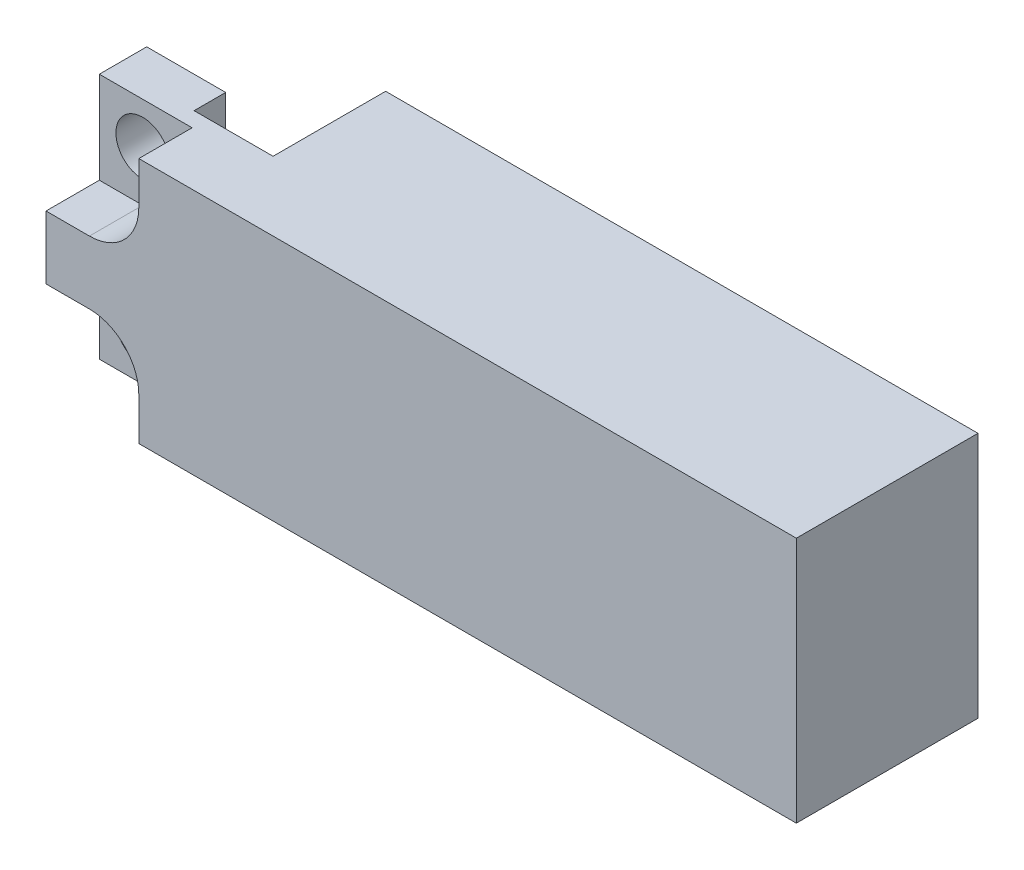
ISO-10303-21;
HEADER;
FILE_DESCRIPTION(('STEP AP214'),'2;1');
FILE_NAME('part.step','',(''),(''),'','','');
FILE_SCHEMA(('AUTOMOTIVE_DESIGN { 1 0 10303 214 1 1 1 1 }'));
ENDSEC;
DATA;
#1=APPLICATION_CONTEXT('core data for automotive mechanical design processes');
#2=APPLICATION_PROTOCOL_DEFINITION('international standard','automotive_design',2000,#1);
#3=PRODUCT_CONTEXT('',#1,'mechanical');
#4=PRODUCT('Part','Part','',(#3));
#5=PRODUCT_RELATED_PRODUCT_CATEGORY('part','',(#4));
#6=PRODUCT_DEFINITION_FORMATION('','',#4);
#7=PRODUCT_DEFINITION_CONTEXT('part definition',#1,'design');
#8=PRODUCT_DEFINITION('design','',#6,#7);
#9=PRODUCT_DEFINITION_SHAPE('','',#8);
#10=(LENGTH_UNIT() NAMED_UNIT(*) SI_UNIT(.MILLI.,.METRE.));
#11=(NAMED_UNIT(*) PLANE_ANGLE_UNIT() SI_UNIT($,.RADIAN.));
#12=(NAMED_UNIT(*) SI_UNIT($,.STERADIAN.) SOLID_ANGLE_UNIT());
#13=UNCERTAINTY_MEASURE_WITH_UNIT(LENGTH_MEASURE(1.E-05),#10,'distance_accuracy_value','');
#14=(GEOMETRIC_REPRESENTATION_CONTEXT(3) GLOBAL_UNCERTAINTY_ASSIGNED_CONTEXT((#13)) GLOBAL_UNIT_ASSIGNED_CONTEXT((#10,
#11,#12)) REPRESENTATION_CONTEXT('',''));
#15=CARTESIAN_POINT('',(0.,0.,0.));
#16=DIRECTION('',(0.,0.,1.));
#17=DIRECTION('',(1.,0.,0.));
#18=AXIS2_PLACEMENT_3D('',#15,#16,#17);
#19=CARTESIAN_POINT('',(-10.16,7.9375,0.));
#20=DIRECTION('',(0.,0.,-1.));
#21=DIRECTION('',(-1.,0.,0.));
#22=AXIS2_PLACEMENT_3D('',#19,#20,#21);
#23=PLANE('',#22);
#24=DIRECTION('',(0.,-1.,0.));
#25=VECTOR('',#24,1.);
#26=CARTESIAN_POINT('',(-4.191,-5.207,0.));
#27=LINE('',#26,#25);
#28=CARTESIAN_POINT('',(-4.191,-5.207,0.));
#29=VERTEX_POINT('',#28);
#30=CARTESIAN_POINT('',(-4.191,-7.9375,0.));
#31=VERTEX_POINT('',#30);
#32=EDGE_CURVE('E182',#29,#31,#27,.T.);
#33=ORIENTED_EDGE('',*,*,#32,.T.);
#34=DIRECTION('',(1.,0.,0.));
#35=VECTOR('',#34,1.);
#36=CARTESIAN_POINT('',(-10.16,-7.9375,0.));
#37=LINE('',#36,#35);
#38=CARTESIAN_POINT('',(38.1,-7.9375,0.));
#39=VERTEX_POINT('',#38);
#40=EDGE_CURVE('E247',#31,#39,#37,.T.);
#41=ORIENTED_EDGE('',*,*,#40,.T.);
#42=DIRECTION('',(0.,-1.,0.));
#43=VECTOR('',#42,1.);
#44=CARTESIAN_POINT('',(38.1,7.9375,0.));
#45=LINE('',#44,#43);
#46=CARTESIAN_POINT('',(38.1,7.9375,0.));
#47=VERTEX_POINT('',#46);
#48=EDGE_CURVE('E272',#47,#39,#45,.T.);
#49=ORIENTED_EDGE('',*,*,#48,.F.);
#50=DIRECTION('',(1.,0.,0.));
#51=VECTOR('',#50,1.);
#52=CARTESIAN_POINT('',(-10.16,7.9375,0.));
#53=LINE('',#52,#51);
#54=CARTESIAN_POINT('',(-4.191,7.9375,0.));
#55=VERTEX_POINT('',#54);
#56=EDGE_CURVE('E230',#55,#47,#53,.T.);
#57=ORIENTED_EDGE('',*,*,#56,.F.);
#58=DIRECTION('',(0.,1.,0.));
#59=VECTOR('',#58,1.);
#60=CARTESIAN_POINT('',(-4.191,5.207,0.));
#61=LINE('',#60,#59);
#62=CARTESIAN_POINT('',(-4.191,5.207,0.));
#63=VERTEX_POINT('',#62);
#64=EDGE_CURVE('E194',#63,#55,#61,.T.);
#65=ORIENTED_EDGE('',*,*,#64,.F.);
#66=CARTESIAN_POINT('',(-7.366,5.207,0.));
#67=DIRECTION('',(0.,0.,1.));
#68=DIRECTION('',(1.,0.,0.));
#69=AXIS2_PLACEMENT_3D('',#66,#67,#68);
#70=CIRCLE('',#69,3.175);
#71=CARTESIAN_POINT('',(-7.366,2.032,0.));
#72=VERTEX_POINT('',#71);
#73=EDGE_CURVE('E216',#72,#63,#70,.T.);
#74=ORIENTED_EDGE('',*,*,#73,.F.);
#75=DIRECTION('',(1.,0.,0.));
#76=VECTOR('',#75,1.);
#77=CARTESIAN_POINT('',(-10.16,2.032,0.));
#78=LINE('',#77,#76);
#79=CARTESIAN_POINT('',(-10.16,2.032,0.));
#80=VERTEX_POINT('',#79);
#81=EDGE_CURVE('E61',#80,#72,#78,.T.);
#82=ORIENTED_EDGE('',*,*,#81,.F.);
#83=DIRECTION('',(0.,-1.,0.));
#84=VECTOR('',#83,1.);
#85=CARTESIAN_POINT('',(-10.16,7.9375,0.));
#86=LINE('',#85,#84);
#87=CARTESIAN_POINT('',(-10.16,-2.032,0.));
#88=VERTEX_POINT('',#87);
#89=EDGE_CURVE('E275',#80,#88,#86,.T.);
#90=ORIENTED_EDGE('',*,*,#89,.T.);
#91=DIRECTION('',(1.,0.,0.));
#92=VECTOR('',#91,1.);
#93=CARTESIAN_POINT('',(-10.16,-2.032,0.));
#94=LINE('',#93,#92);
#95=CARTESIAN_POINT('',(-7.366,-2.032,0.));
#96=VERTEX_POINT('',#95);
#97=EDGE_CURVE('E169',#88,#96,#94,.T.);
#98=ORIENTED_EDGE('',*,*,#97,.T.);
#99=CARTESIAN_POINT('',(-7.366,-5.207,0.));
#100=DIRECTION('',(0.,0.,1.));
#101=DIRECTION('',(1.,0.,0.));
#102=AXIS2_PLACEMENT_3D('',#99,#100,#101);
#103=CIRCLE('',#102,3.175);
#104=EDGE_CURVE('E46',#29,#96,#103,.T.);
#105=ORIENTED_EDGE('',*,*,#104,.F.);
#106=EDGE_LOOP('',(#33,#41,#49,#57,#65,#74,#82,#90,#98,#105));
#107=FACE_BOUND('',#106,.T.);
#108=ADVANCED_FACE('F37',(#107),#23,.F.);
#109=CARTESIAN_POINT('',(-10.16,7.9375,-6.477));
#110=DIRECTION('',(1.,0.,0.));
#111=DIRECTION('',(0.,0.,-1.));
#112=AXIS2_PLACEMENT_3D('',#109,#110,#111);
#113=PLANE('',#112);
#114=DIRECTION('',(0.,0.,1.));
#115=VECTOR('',#114,1.);
#116=CARTESIAN_POINT('',(-10.16,-7.9375,-6.477));
#117=LINE('',#116,#115);
#118=CARTESIAN_POINT('',(-10.16,-7.9375,-6.477));
#119=VERTEX_POINT('',#118);
#120=CARTESIAN_POINT('',(-10.16,-7.9375,-3.429));
#121=VERTEX_POINT('',#120);
#122=EDGE_CURVE('E159',#119,#121,#117,.T.);
#123=ORIENTED_EDGE('',*,*,#122,.T.);
#124=DIRECTION('',(0.,1.,0.));
#125=VECTOR('',#124,1.);
#126=CARTESIAN_POINT('',(-10.16,7.9375,-3.429));
#127=LINE('',#126,#125);
#128=CARTESIAN_POINT('',(-10.16,-2.032,-3.429));
#129=VERTEX_POINT('',#128);
#130=EDGE_CURVE('E152',#121,#129,#127,.T.);
#131=ORIENTED_EDGE('',*,*,#130,.T.);
#132=DIRECTION('',(0.,0.,1.));
#133=VECTOR('',#132,1.);
#134=CARTESIAN_POINT('',(-10.16,-2.032,-11.8256595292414));
#135=LINE('',#134,#133);
#136=EDGE_CURVE('E156',#129,#88,#135,.T.);
#137=ORIENTED_EDGE('',*,*,#136,.T.);
#138=ORIENTED_EDGE('',*,*,#89,.F.);
#139=DIRECTION('',(0.,0.,1.));
#140=VECTOR('',#139,1.);
#141=CARTESIAN_POINT('',(-10.16,2.032,-11.8256595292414));
#142=LINE('',#141,#140);
#143=CARTESIAN_POINT('',(-10.16,2.032,-3.429));
#144=VERTEX_POINT('',#143);
#145=EDGE_CURVE('E203',#144,#80,#142,.T.);
#146=ORIENTED_EDGE('',*,*,#145,.F.);
#147=DIRECTION('',(0.,1.,0.));
#148=VECTOR('',#147,1.);
#149=CARTESIAN_POINT('',(-10.16,7.9375,-3.429));
#150=LINE('',#149,#148);
#151=CARTESIAN_POINT('',(-10.16,7.9375,-3.429));
#152=VERTEX_POINT('',#151);
#153=EDGE_CURVE('E219',#144,#152,#150,.T.);
#154=ORIENTED_EDGE('',*,*,#153,.T.);
#155=DIRECTION('',(0.,0.,1.));
#156=VECTOR('',#155,1.);
#157=CARTESIAN_POINT('',(-10.16,7.9375,-6.477));
#158=LINE('',#157,#156);
#159=CARTESIAN_POINT('',(-10.16,7.9375,-6.477));
#160=VERTEX_POINT('',#159);
#161=EDGE_CURVE('E226',#160,#152,#158,.T.);
#162=ORIENTED_EDGE('',*,*,#161,.F.);
#163=DIRECTION('',(0.,-1.,0.));
#164=VECTOR('',#163,1.);
#165=CARTESIAN_POINT('',(-10.16,7.9375,-6.477));
#166=LINE('',#165,#164);
#167=EDGE_CURVE('E277',#160,#119,#166,.T.);
#168=ORIENTED_EDGE('',*,*,#167,.T.);
#169=EDGE_LOOP('',(#123,#131,#137,#138,#146,#154,#162,#168));
#170=FACE_BOUND('',#169,.T.);
#171=ADVANCED_FACE('F154',(#170),#113,.F.);
#172=CARTESIAN_POINT('',(-10.16,-7.9375,-6.477));
#173=DIRECTION('',(0.,-1.,0.));
#174=DIRECTION('',(0.,0.,-1.));
#175=AXIS2_PLACEMENT_3D('',#172,#173,#174);
#176=PLANE('',#175);
#177=DIRECTION('',(1.,0.,0.));
#178=VECTOR('',#177,1.);
#179=CARTESIAN_POINT('',(-10.16,-7.9375,-3.429));
#180=LINE('',#179,#178);
#181=CARTESIAN_POINT('',(-4.191,-7.9375,-3.429));
#182=VERTEX_POINT('',#181);
#183=EDGE_CURVE('E11',#121,#182,#180,.T.);
#184=ORIENTED_EDGE('',*,*,#183,.F.);
#185=ORIENTED_EDGE('',*,*,#122,.F.);
#186=DIRECTION('',(-1.,0.,0.));
#187=VECTOR('',#186,1.);
#188=CARTESIAN_POINT('',(-10.16,-7.9375,-6.477));
#189=LINE('',#188,#187);
#190=CARTESIAN_POINT('',(-5.08,-7.9375,-6.477));
#191=VERTEX_POINT('',#190);
#192=EDGE_CURVE('E243',#191,#119,#189,.T.);
#193=ORIENTED_EDGE('',*,*,#192,.F.);
#194=DIRECTION('',(0.,0.,-1.));
#195=VECTOR('',#194,1.);
#196=CARTESIAN_POINT('',(-5.08,-7.9375,-6.477));
#197=LINE('',#196,#195);
#198=CARTESIAN_POINT('',(-5.08,-7.9375,-4.445));
#199=VERTEX_POINT('',#198);
#200=EDGE_CURVE('E227',#199,#191,#197,.T.);
#201=ORIENTED_EDGE('',*,*,#200,.F.);
#202=DIRECTION('',(-1.,0.,0.));
#203=VECTOR('',#202,1.);
#204=CARTESIAN_POINT('',(-5.08,-7.9375,-4.445));
#205=LINE('',#204,#203);
#206=CARTESIAN_POINT('',(0.,-7.9375,-4.445));
#207=VERTEX_POINT('',#206);
#208=EDGE_CURVE('E255',#207,#199,#205,.T.);
#209=ORIENTED_EDGE('',*,*,#208,.F.);
#210=DIRECTION('',(0.,0.,1.));
#211=VECTOR('',#210,1.);
#212=CARTESIAN_POINT('',(0.,-7.9375,-4.445));
#213=LINE('',#212,#211);
#214=CARTESIAN_POINT('',(0.,-7.9375,-11.684));
#215=VERTEX_POINT('',#214);
#216=EDGE_CURVE('E253',#215,#207,#213,.T.);
#217=ORIENTED_EDGE('',*,*,#216,.F.);
#218=DIRECTION('',(-1.,0.,0.));
#219=VECTOR('',#218,1.);
#220=CARTESIAN_POINT('',(0.,-7.9375,-11.684));
#221=LINE('',#220,#219);
#222=CARTESIAN_POINT('',(38.1,-7.9375,-11.684));
#223=VERTEX_POINT('',#222);
#224=EDGE_CURVE('E251',#223,#215,#221,.T.);
#225=ORIENTED_EDGE('',*,*,#224,.F.);
#226=DIRECTION('',(0.,0.,-1.));
#227=VECTOR('',#226,1.);
#228=CARTESIAN_POINT('',(38.1,-7.9375,-11.684));
#229=LINE('',#228,#227);
#230=EDGE_CURVE('E249',#39,#223,#229,.T.);
#231=ORIENTED_EDGE('',*,*,#230,.F.);
#232=ORIENTED_EDGE('',*,*,#40,.F.);
#233=DIRECTION('',(0.,0.,1.));
#234=VECTOR('',#233,1.);
#235=CARTESIAN_POINT('',(-4.191,-7.9375,-11.8256595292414));
#236=LINE('',#235,#234);
#237=EDGE_CURVE('E170',#182,#31,#236,.T.);
#238=ORIENTED_EDGE('',*,*,#237,.F.);
#239=EDGE_LOOP('',(#184,#185,#193,#201,#209,#217,#225,#231,#232,#238));
#240=FACE_BOUND('',#239,.T.);
#241=ADVANCED_FACE('F308',(#240),#176,.T.);
#242=CARTESIAN_POINT('',(-7.366,-5.207,0.));
#243=DIRECTION('',(0.,0.,1.));
#244=DIRECTION('',(1.,0.,0.));
#245=AXIS2_PLACEMENT_3D('',#242,#243,#244);
#246=CYLINDRICAL_SURFACE('',#245,3.175);
#247=DIRECTION('',(0.,0.,1.));
#248=VECTOR('',#247,1.);
#249=CARTESIAN_POINT('',(-4.191,-5.207,-11.8256595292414));
#250=LINE('',#249,#248);
#251=CARTESIAN_POINT('',(-4.191,-5.207,-3.429));
#252=VERTEX_POINT('',#251);
#253=EDGE_CURVE('E53',#252,#29,#250,.T.);
#254=ORIENTED_EDGE('',*,*,#253,.T.);
#255=ORIENTED_EDGE('',*,*,#104,.T.);
#256=DIRECTION('',(0.,0.,1.));
#257=VECTOR('',#256,1.);
#258=CARTESIAN_POINT('',(-7.366,-2.032,-11.8256595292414));
#259=LINE('',#258,#257);
#260=CARTESIAN_POINT('',(-7.366,-2.032,-3.429));
#261=VERTEX_POINT('',#260);
#262=EDGE_CURVE('E183',#261,#96,#259,.T.);
#263=ORIENTED_EDGE('',*,*,#262,.F.);
#264=CARTESIAN_POINT('',(-7.366,-5.207,-3.429));
#265=DIRECTION('',(0.,0.,1.));
#266=DIRECTION('',(1.,0.,0.));
#267=AXIS2_PLACEMENT_3D('',#264,#265,#266);
#268=CIRCLE('',#267,3.175);
#269=EDGE_CURVE('E162',#252,#261,#268,.T.);
#270=ORIENTED_EDGE('',*,*,#269,.F.);
#271=EDGE_LOOP('',(#254,#255,#263,#270));
#272=FACE_BOUND('',#271,.T.);
#273=ADVANCED_FACE('F331',(#272),#246,.F.);
#274=CARTESIAN_POINT('',(-7.366,5.207,0.));
#275=DIRECTION('',(0.,0.,1.));
#276=DIRECTION('',(1.,0.,0.));
#277=AXIS2_PLACEMENT_3D('',#274,#275,#276);
#278=CYLINDRICAL_SURFACE('',#277,3.175);
#279=ORIENTED_EDGE('',*,*,#73,.T.);
#280=DIRECTION('',(0.,0.,1.));
#281=VECTOR('',#280,1.);
#282=CARTESIAN_POINT('',(-4.191,5.207,-11.8256595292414));
#283=LINE('',#282,#281);
#284=CARTESIAN_POINT('',(-4.191,5.207,-3.429));
#285=VERTEX_POINT('',#284);
#286=EDGE_CURVE('E205',#285,#63,#283,.T.);
#287=ORIENTED_EDGE('',*,*,#286,.F.);
#288=CARTESIAN_POINT('',(-7.366,5.207,-3.429));
#289=DIRECTION('',(0.,0.,1.));
#290=DIRECTION('',(1.,0.,0.));
#291=AXIS2_PLACEMENT_3D('',#288,#289,#290);
#292=CIRCLE('',#291,3.175);
#293=CARTESIAN_POINT('',(-7.366,2.032,-3.429));
#294=VERTEX_POINT('',#293);
#295=EDGE_CURVE('E213',#294,#285,#292,.T.);
#296=ORIENTED_EDGE('',*,*,#295,.F.);
#297=DIRECTION('',(0.,0.,1.));
#298=VECTOR('',#297,1.);
#299=CARTESIAN_POINT('',(-7.366,2.032,-11.8256595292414));
#300=LINE('',#299,#298);
#301=EDGE_CURVE('E202',#294,#72,#300,.T.);
#302=ORIENTED_EDGE('',*,*,#301,.T.);
#303=EDGE_LOOP('',(#279,#287,#296,#302));
#304=FACE_BOUND('',#303,.T.);
#305=ADVANCED_FACE('F334',(#304),#278,.F.);
#306=CARTESIAN_POINT('',(-10.16,7.9375,-6.477));
#307=DIRECTION('',(0.,0.,1.));
#308=DIRECTION('',(1.,0.,0.));
#309=AXIS2_PLACEMENT_3D('',#306,#307,#308);
#310=PLANE('',#309);
#311=CARTESIAN_POINT('',(-7.366,-5.207,-6.477));
#312=DIRECTION('',(0.,0.,1.));
#313=DIRECTION('',(1.,0.,0.));
#314=AXIS2_PLACEMENT_3D('',#311,#312,#313);
#315=CIRCLE('',#314,1.7272);
#316=CARTESIAN_POINT('',(-5.6388,-5.207,-6.477));
#317=VERTEX_POINT('',#316);
#318=EDGE_CURVE('E41',#317,#317,#315,.T.);
#319=ORIENTED_EDGE('',*,*,#318,.T.);
#320=EDGE_LOOP('',(#319));
#321=FACE_BOUND('',#320,.T.);
#322=CARTESIAN_POINT('',(-7.366,5.207,-6.477));
#323=DIRECTION('',(0.,0.,1.));
#324=DIRECTION('',(1.,0.,0.));
#325=AXIS2_PLACEMENT_3D('',#322,#323,#324);
#326=CIRCLE('',#325,1.7272);
#327=CARTESIAN_POINT('',(-5.6388,5.207,-6.477));
#328=VERTEX_POINT('',#327);
#329=EDGE_CURVE('E222',#328,#328,#326,.T.);
#330=ORIENTED_EDGE('',*,*,#329,.T.);
#331=EDGE_LOOP('',(#330));
#332=FACE_BOUND('',#331,.T.);
#333=ORIENTED_EDGE('',*,*,#192,.T.);
#334=ORIENTED_EDGE('',*,*,#167,.F.);
#335=DIRECTION('',(-1.,0.,0.));
#336=VECTOR('',#335,1.);
#337=CARTESIAN_POINT('',(-10.16,7.9375,-6.477));
#338=LINE('',#337,#336);
#339=CARTESIAN_POINT('',(-5.08,7.9375,-6.477));
#340=VERTEX_POINT('',#339);
#341=EDGE_CURVE('E223',#340,#160,#338,.T.);
#342=ORIENTED_EDGE('',*,*,#341,.F.);
#343=DIRECTION('',(0.,-1.,0.));
#344=VECTOR('',#343,1.);
#345=CARTESIAN_POINT('',(-5.08,7.9375,-6.477));
#346=LINE('',#345,#344);
#347=EDGE_CURVE('E242',#340,#191,#346,.T.);
#348=ORIENTED_EDGE('',*,*,#347,.T.);
#349=EDGE_LOOP('',(#333,#334,#342,#348));
#350=FACE_BOUND('',#349,.T.);
#351=ADVANCED_FACE('F39',(#321,#332,#350),#310,.F.);
#352=CARTESIAN_POINT('',(38.1,7.9375,-11.684));
#353=DIRECTION('',(-1.,0.,0.));
#354=DIRECTION('',(0.,0.,1.));
#355=AXIS2_PLACEMENT_3D('',#352,#353,#354);
#356=PLANE('',#355);
#357=ORIENTED_EDGE('',*,*,#230,.T.);
#358=DIRECTION('',(0.,-1.,0.));
#359=VECTOR('',#358,1.);
#360=CARTESIAN_POINT('',(38.1,7.9375,-11.684));
#361=LINE('',#360,#359);
#362=CARTESIAN_POINT('',(38.1,7.9375,-11.684));
#363=VERTEX_POINT('',#362);
#364=EDGE_CURVE('E269',#363,#223,#361,.T.);
#365=ORIENTED_EDGE('',*,*,#364,.F.);
#366=DIRECTION('',(0.,0.,-1.));
#367=VECTOR('',#366,1.);
#368=CARTESIAN_POINT('',(38.1,7.9375,-11.684));
#369=LINE('',#368,#367);
#370=EDGE_CURVE('E232',#47,#363,#369,.T.);
#371=ORIENTED_EDGE('',*,*,#370,.F.);
#372=ORIENTED_EDGE('',*,*,#48,.T.);
#373=EDGE_LOOP('',(#357,#365,#371,#372));
#374=FACE_BOUND('',#373,.T.);
#375=ADVANCED_FACE('F311',(#374),#356,.F.);
#376=CARTESIAN_POINT('',(0.,7.9375,-11.684));
#377=DIRECTION('',(0.,0.,1.));
#378=DIRECTION('',(1.,0.,0.));
#379=AXIS2_PLACEMENT_3D('',#376,#377,#378);
#380=PLANE('',#379);
#381=ORIENTED_EDGE('',*,*,#224,.T.);
#382=DIRECTION('',(0.,-1.,0.));
#383=VECTOR('',#382,1.);
#384=CARTESIAN_POINT('',(0.,7.9375,-11.684));
#385=LINE('',#384,#383);
#386=CARTESIAN_POINT('',(0.,7.9375,-11.684));
#387=VERTEX_POINT('',#386);
#388=EDGE_CURVE('E266',#387,#215,#385,.T.);
#389=ORIENTED_EDGE('',*,*,#388,.F.);
#390=DIRECTION('',(-1.,0.,0.));
#391=VECTOR('',#390,1.);
#392=CARTESIAN_POINT('',(0.,7.9375,-11.684));
#393=LINE('',#392,#391);
#394=EDGE_CURVE('E234',#363,#387,#393,.T.);
#395=ORIENTED_EDGE('',*,*,#394,.F.);
#396=ORIENTED_EDGE('',*,*,#364,.T.);
#397=EDGE_LOOP('',(#381,#389,#395,#396));
#398=FACE_BOUND('',#397,.T.);
#399=ADVANCED_FACE('F314',(#398),#380,.F.);
#400=CARTESIAN_POINT('',(0.,7.9375,-4.445));
#401=DIRECTION('',(1.,0.,0.));
#402=DIRECTION('',(0.,0.,-1.));
#403=AXIS2_PLACEMENT_3D('',#400,#401,#402);
#404=PLANE('',#403);
#405=ORIENTED_EDGE('',*,*,#216,.T.);
#406=DIRECTION('',(0.,-1.,0.));
#407=VECTOR('',#406,1.);
#408=CARTESIAN_POINT('',(0.,7.9375,-4.445));
#409=LINE('',#408,#407);
#410=CARTESIAN_POINT('',(0.,7.9375,-4.445));
#411=VERTEX_POINT('',#410);
#412=EDGE_CURVE('E263',#411,#207,#409,.T.);
#413=ORIENTED_EDGE('',*,*,#412,.F.);
#414=DIRECTION('',(0.,0.,1.));
#415=VECTOR('',#414,1.);
#416=CARTESIAN_POINT('',(0.,7.9375,-4.445));
#417=LINE('',#416,#415);
#418=EDGE_CURVE('E236',#387,#411,#417,.T.);
#419=ORIENTED_EDGE('',*,*,#418,.F.);
#420=ORIENTED_EDGE('',*,*,#388,.T.);
#421=EDGE_LOOP('',(#405,#413,#419,#420));
#422=FACE_BOUND('',#421,.T.);
#423=ADVANCED_FACE('F318',(#422),#404,.F.);
#424=CARTESIAN_POINT('',(-5.08,7.9375,-4.445));
#425=DIRECTION('',(0.,0.,1.));
#426=DIRECTION('',(1.,0.,0.));
#427=AXIS2_PLACEMENT_3D('',#424,#425,#426);
#428=PLANE('',#427);
#429=ORIENTED_EDGE('',*,*,#208,.T.);
#430=DIRECTION('',(0.,-1.,0.));
#431=VECTOR('',#430,1.);
#432=CARTESIAN_POINT('',(-5.08,7.9375,-4.445));
#433=LINE('',#432,#431);
#434=CARTESIAN_POINT('',(-5.08,7.9375,-4.445));
#435=VERTEX_POINT('',#434);
#436=EDGE_CURVE('E260',#435,#199,#433,.T.);
#437=ORIENTED_EDGE('',*,*,#436,.F.);
#438=DIRECTION('',(-1.,0.,0.));
#439=VECTOR('',#438,1.);
#440=CARTESIAN_POINT('',(-5.08,7.9375,-4.445));
#441=LINE('',#440,#439);
#442=EDGE_CURVE('E238',#411,#435,#441,.T.);
#443=ORIENTED_EDGE('',*,*,#442,.F.);
#444=ORIENTED_EDGE('',*,*,#412,.T.);
#445=EDGE_LOOP('',(#429,#437,#443,#444));
#446=FACE_BOUND('',#445,.T.);
#447=ADVANCED_FACE('F322',(#446),#428,.F.);
#448=CARTESIAN_POINT('',(-5.08,7.9375,-6.477));
#449=DIRECTION('',(-1.,0.,0.));
#450=DIRECTION('',(0.,0.,1.));
#451=AXIS2_PLACEMENT_3D('',#448,#449,#450);
#452=PLANE('',#451);
#453=ORIENTED_EDGE('',*,*,#200,.T.);
#454=ORIENTED_EDGE('',*,*,#347,.F.);
#455=DIRECTION('',(0.,0.,-1.));
#456=VECTOR('',#455,1.);
#457=CARTESIAN_POINT('',(-5.08,7.9375,-6.477));
#458=LINE('',#457,#456);
#459=EDGE_CURVE('E240',#435,#340,#458,.T.);
#460=ORIENTED_EDGE('',*,*,#459,.F.);
#461=ORIENTED_EDGE('',*,*,#436,.T.);
#462=EDGE_LOOP('',(#453,#454,#460,#461));
#463=FACE_BOUND('',#462,.T.);
#464=ADVANCED_FACE('F298',(#463),#452,.F.);
#465=CARTESIAN_POINT('',(-10.16,7.9375,-6.477));
#466=DIRECTION('',(0.,-1.,0.));
#467=DIRECTION('',(0.,0.,-1.));
#468=AXIS2_PLACEMENT_3D('',#465,#466,#467);
#469=PLANE('',#468);
#470=ORIENTED_EDGE('',*,*,#161,.T.);
#471=DIRECTION('',(1.,0.,0.));
#472=VECTOR('',#471,1.);
#473=CARTESIAN_POINT('',(-10.16,7.9375,-3.429));
#474=LINE('',#473,#472);
#475=CARTESIAN_POINT('',(-4.191,7.9375,-3.429));
#476=VERTEX_POINT('',#475);
#477=EDGE_CURVE('E190',#152,#476,#474,.T.);
#478=ORIENTED_EDGE('',*,*,#477,.T.);
#479=DIRECTION('',(0.,0.,1.));
#480=VECTOR('',#479,1.);
#481=CARTESIAN_POINT('',(-4.191,7.9375,-11.8256595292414));
#482=LINE('',#481,#480);
#483=EDGE_CURVE('E198',#476,#55,#482,.T.);
#484=ORIENTED_EDGE('',*,*,#483,.T.);
#485=ORIENTED_EDGE('',*,*,#56,.T.);
#486=ORIENTED_EDGE('',*,*,#370,.T.);
#487=ORIENTED_EDGE('',*,*,#394,.T.);
#488=ORIENTED_EDGE('',*,*,#418,.T.);
#489=ORIENTED_EDGE('',*,*,#442,.T.);
#490=ORIENTED_EDGE('',*,*,#459,.T.);
#491=ORIENTED_EDGE('',*,*,#341,.T.);
#492=EDGE_LOOP('',(#470,#478,#484,#485,#486,#487,#488,#489,#490,#491));
#493=FACE_BOUND('',#492,.T.);
#494=ADVANCED_FACE('F288',(#493),#469,.F.);
#495=CARTESIAN_POINT('',(-7.366,5.207,0.));
#496=DIRECTION('',(0.,0.,1.));
#497=DIRECTION('',(1.,0.,0.));
#498=AXIS2_PLACEMENT_3D('',#495,#496,#497);
#499=CYLINDRICAL_SURFACE('',#498,1.7272);
#500=CARTESIAN_POINT('',(-7.366,5.207,-3.429));
#501=DIRECTION('',(0.,0.,1.));
#502=DIRECTION('',(1.,0.,0.));
#503=AXIS2_PLACEMENT_3D('',#500,#501,#502);
#504=CIRCLE('',#503,1.7272);
#505=CARTESIAN_POINT('',(-5.6388,5.207,-3.429));
#506=VERTEX_POINT('',#505);
#507=EDGE_CURVE('E210',#506,#506,#504,.T.);
#508=ORIENTED_EDGE('',*,*,#507,.T.);
#509=EDGE_LOOP('',(#508));
#510=FACE_BOUND('',#509,.T.);
#511=ORIENTED_EDGE('',*,*,#329,.F.);
#512=EDGE_LOOP('',(#511));
#513=FACE_BOUND('',#512,.T.);
#514=ADVANCED_FACE('F285',(#510,#513),#499,.F.);
#515=CARTESIAN_POINT('',(-5.6388,5.207,-3.429));
#516=DIRECTION('',(0.,0.,-1.));
#517=DIRECTION('',(-1.,0.,0.));
#518=AXIS2_PLACEMENT_3D('',#515,#516,#517);
#519=PLANE('',#518);
#520=ORIENTED_EDGE('',*,*,#507,.F.);
#521=EDGE_LOOP('',(#520));
#522=FACE_BOUND('',#521,.T.);
#523=ORIENTED_EDGE('',*,*,#153,.F.);
#524=DIRECTION('',(1.,0.,0.));
#525=VECTOR('',#524,1.);
#526=CARTESIAN_POINT('',(-10.16,2.032,-3.429));
#527=LINE('',#526,#525);
#528=EDGE_CURVE('E199',#144,#294,#527,.T.);
#529=ORIENTED_EDGE('',*,*,#528,.T.);
#530=ORIENTED_EDGE('',*,*,#295,.T.);
#531=DIRECTION('',(0.,1.,0.));
#532=VECTOR('',#531,1.);
#533=CARTESIAN_POINT('',(-4.191,5.207,-3.429));
#534=LINE('',#533,#532);
#535=EDGE_CURVE('E193',#285,#476,#534,.T.);
#536=ORIENTED_EDGE('',*,*,#535,.T.);
#537=ORIENTED_EDGE('',*,*,#477,.F.);
#538=EDGE_LOOP('',(#523,#529,#530,#536,#537));
#539=FACE_BOUND('',#538,.T.);
#540=ADVANCED_FACE('F287',(#522,#539),#519,.F.);
#541=CARTESIAN_POINT('',(-10.16,2.032,-11.8256595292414));
#542=DIRECTION('',(0.,-1.,0.));
#543=DIRECTION('',(0.,0.,-1.));
#544=AXIS2_PLACEMENT_3D('',#541,#542,#543);
#545=PLANE('',#544);
#546=ORIENTED_EDGE('',*,*,#145,.T.);
#547=ORIENTED_EDGE('',*,*,#81,.T.);
#548=ORIENTED_EDGE('',*,*,#301,.F.);
#549=ORIENTED_EDGE('',*,*,#528,.F.);
#550=EDGE_LOOP('',(#546,#547,#548,#549));
#551=FACE_BOUND('',#550,.T.);
#552=ADVANCED_FACE('F295',(#551),#545,.F.);
#553=CARTESIAN_POINT('',(-4.191,5.207,-11.8256595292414));
#554=DIRECTION('',(1.,0.,0.));
#555=DIRECTION('',(0.,0.,-1.));
#556=AXIS2_PLACEMENT_3D('',#553,#554,#555);
#557=PLANE('',#556);
#558=ORIENTED_EDGE('',*,*,#286,.T.);
#559=ORIENTED_EDGE('',*,*,#64,.T.);
#560=ORIENTED_EDGE('',*,*,#483,.F.);
#561=ORIENTED_EDGE('',*,*,#535,.F.);
#562=EDGE_LOOP('',(#558,#559,#560,#561));
#563=FACE_BOUND('',#562,.T.);
#564=ADVANCED_FACE('F352',(#563),#557,.F.);
#565=CARTESIAN_POINT('',(-7.366,-5.207,0.));
#566=DIRECTION('',(0.,0.,1.));
#567=DIRECTION('',(1.,0.,0.));
#568=AXIS2_PLACEMENT_3D('',#565,#566,#567);
#569=CYLINDRICAL_SURFACE('',#568,1.7272);
#570=CARTESIAN_POINT('',(-7.366,-5.207,-3.429));
#571=DIRECTION('',(0.,0.,1.));
#572=DIRECTION('',(1.,0.,0.));
#573=AXIS2_PLACEMENT_3D('',#570,#571,#572);
#574=CIRCLE('',#573,1.7272);
#575=CARTESIAN_POINT('',(-5.6388,-5.207,-3.429));
#576=VERTEX_POINT('',#575);
#577=EDGE_CURVE('E177',#576,#576,#574,.T.);
#578=ORIENTED_EDGE('',*,*,#577,.T.);
#579=EDGE_LOOP('',(#578));
#580=FACE_BOUND('',#579,.T.);
#581=ORIENTED_EDGE('',*,*,#318,.F.);
#582=EDGE_LOOP('',(#581));
#583=FACE_BOUND('',#582,.T.);
#584=ADVANCED_FACE('F361',(#580,#583),#569,.F.);
#585=CARTESIAN_POINT('',(-5.6388,-5.207,-3.429));
#586=DIRECTION('',(0.,0.,-1.));
#587=DIRECTION('',(-1.,0.,0.));
#588=AXIS2_PLACEMENT_3D('',#585,#586,#587);
#589=PLANE('',#588);
#590=ORIENTED_EDGE('',*,*,#577,.F.);
#591=EDGE_LOOP('',(#590));
#592=FACE_BOUND('',#591,.T.);
#593=ORIENTED_EDGE('',*,*,#130,.F.);
#594=ORIENTED_EDGE('',*,*,#183,.T.);
#595=DIRECTION('',(0.,-1.,0.));
#596=VECTOR('',#595,1.);
#597=CARTESIAN_POINT('',(-4.191,-5.207,-3.429));
#598=LINE('',#597,#596);
#599=EDGE_CURVE('E175',#252,#182,#598,.T.);
#600=ORIENTED_EDGE('',*,*,#599,.F.);
#601=ORIENTED_EDGE('',*,*,#269,.T.);
#602=DIRECTION('',(1.,0.,0.));
#603=VECTOR('',#602,1.);
#604=CARTESIAN_POINT('',(-10.16,-2.032,-3.429));
#605=LINE('',#604,#603);
#606=EDGE_CURVE('E166',#129,#261,#605,.T.);
#607=ORIENTED_EDGE('',*,*,#606,.F.);
#608=EDGE_LOOP('',(#593,#594,#600,#601,#607));
#609=FACE_BOUND('',#608,.T.);
#610=ADVANCED_FACE('F173',(#592,#609),#589,.F.);
#611=CARTESIAN_POINT('',(-10.16,-2.032,-11.8256595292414));
#612=DIRECTION('',(0.,-1.,0.));
#613=DIRECTION('',(0.,0.,-1.));
#614=AXIS2_PLACEMENT_3D('',#611,#612,#613);
#615=PLANE('',#614);
#616=ORIENTED_EDGE('',*,*,#606,.T.);
#617=ORIENTED_EDGE('',*,*,#262,.T.);
#618=ORIENTED_EDGE('',*,*,#97,.F.);
#619=ORIENTED_EDGE('',*,*,#136,.F.);
#620=EDGE_LOOP('',(#616,#617,#618,#619));
#621=FACE_BOUND('',#620,.T.);
#622=ADVANCED_FACE('F165',(#621),#615,.T.);
#623=CARTESIAN_POINT('',(-4.191,-5.207,-11.8256595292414));
#624=DIRECTION('',(-1.,0.,0.));
#625=DIRECTION('',(0.,0.,1.));
#626=AXIS2_PLACEMENT_3D('',#623,#624,#625);
#627=PLANE('',#626);
#628=ORIENTED_EDGE('',*,*,#599,.T.);
#629=ORIENTED_EDGE('',*,*,#237,.T.);
#630=ORIENTED_EDGE('',*,*,#32,.F.);
#631=ORIENTED_EDGE('',*,*,#253,.F.);
#632=EDGE_LOOP('',(#628,#629,#630,#631));
#633=FACE_BOUND('',#632,.T.);
#634=ADVANCED_FACE('F369',(#633),#627,.T.);
#635=CLOSED_SHELL('',(#108,#171,#241,#273,#305,#351,#375,#399,#423,#447,#464,#494,#514,#540,
#552,#564,#584,#610,#622,#634));
#636=MANIFOLD_SOLID_BREP('B2',#635);
#637=ADVANCED_BREP_SHAPE_REPRESENTATION('',(#18,#636),#14);
#638=SHAPE_DEFINITION_REPRESENTATION(#9,#637);
ENDSEC;
END-ISO-10303-21;
